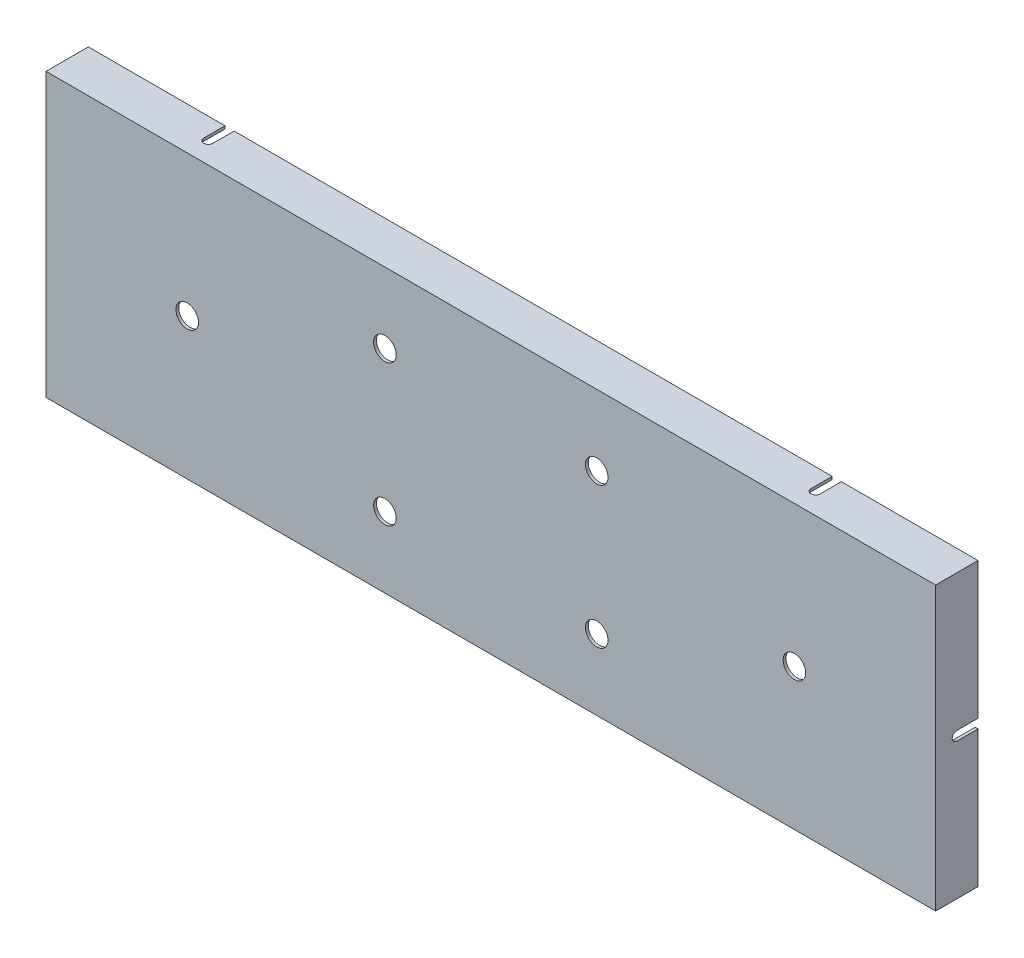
ISO-10303-21;
HEADER;
FILE_DESCRIPTION(('STEP AP214'),'2;1');
FILE_NAME('part.step','',(''),(''),'','','');
FILE_SCHEMA(('AUTOMOTIVE_DESIGN { 1 0 10303 214 1 1 1 1 }'));
ENDSEC;
DATA;
#1=APPLICATION_CONTEXT('core data for automotive mechanical design processes');
#2=APPLICATION_PROTOCOL_DEFINITION('international standard','automotive_design',2000,#1);
#3=PRODUCT_CONTEXT('',#1,'mechanical');
#4=PRODUCT('Part','Part','',(#3));
#5=PRODUCT_RELATED_PRODUCT_CATEGORY('part','',(#4));
#6=PRODUCT_DEFINITION_FORMATION('','',#4);
#7=PRODUCT_DEFINITION_CONTEXT('part definition',#1,'design');
#8=PRODUCT_DEFINITION('design','',#6,#7);
#9=PRODUCT_DEFINITION_SHAPE('','',#8);
#10=(LENGTH_UNIT() NAMED_UNIT(*) SI_UNIT(.MILLI.,.METRE.));
#11=(NAMED_UNIT(*) PLANE_ANGLE_UNIT() SI_UNIT($,.RADIAN.));
#12=(NAMED_UNIT(*) SI_UNIT($,.STERADIAN.) SOLID_ANGLE_UNIT());
#13=UNCERTAINTY_MEASURE_WITH_UNIT(LENGTH_MEASURE(1.E-05),#10,'distance_accuracy_value','');
#14=(GEOMETRIC_REPRESENTATION_CONTEXT(3) GLOBAL_UNCERTAINTY_ASSIGNED_CONTEXT((#13)) GLOBAL_UNIT_ASSIGNED_CONTEXT((#10,
#11,#12)) REPRESENTATION_CONTEXT('',''));
#15=CARTESIAN_POINT('',(0.,0.,0.));
#16=DIRECTION('',(0.,0.,1.));
#17=DIRECTION('',(1.,0.,0.));
#18=AXIS2_PLACEMENT_3D('',#15,#16,#17);
#19=CARTESIAN_POINT('',(0.,-200.,0.));
#20=DIRECTION('',(0.,0.,1.));
#21=DIRECTION('',(1.,0.,0.));
#22=AXIS2_PLACEMENT_3D('',#19,#20,#21);
#23=PLANE('',#22);
#24=DIRECTION('',(0.,1.,0.));
#25=VECTOR('',#24,1.);
#26=CARTESIAN_POINT('',(630.,0.,0.));
#27=LINE('',#26,#25);
#28=CARTESIAN_POINT('',(630.,-96.7499999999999,0.));
#29=VERTEX_POINT('',#28);
#30=CARTESIAN_POINT('',(630.,0.,0.));
#31=VERTEX_POINT('',#30);
#32=EDGE_CURVE('E267',#29,#31,#27,.T.);
#33=ORIENTED_EDGE('',*,*,#32,.F.);
#34=DIRECTION('',(-1.,0.,0.));
#35=VECTOR('',#34,1.);
#36=CARTESIAN_POINT('',(630.,-96.7499999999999,0.));
#37=LINE('',#36,#35);
#38=CARTESIAN_POINT('',(628.,-96.7499999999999,0.));
#39=VERTEX_POINT('',#38);
#40=EDGE_CURVE('E512',#29,#39,#37,.T.);
#41=ORIENTED_EDGE('',*,*,#40,.T.);
#42=DIRECTION('',(0.,1.,0.));
#43=VECTOR('',#42,1.);
#44=CARTESIAN_POINT('',(628.,0.,0.));
#45=LINE('',#44,#43);
#46=CARTESIAN_POINT('',(628.,-2.,0.));
#47=VERTEX_POINT('',#46);
#48=EDGE_CURVE('E323',#39,#47,#45,.T.);
#49=ORIENTED_EDGE('',*,*,#48,.T.);
#50=DIRECTION('',(-1.,0.,0.));
#51=VECTOR('',#50,1.);
#52=CARTESIAN_POINT('',(0.,-2.,0.));
#53=LINE('',#52,#51);
#54=CARTESIAN_POINT('',(533.25,-2.,0.));
#55=VERTEX_POINT('',#54);
#56=EDGE_CURVE('E337',#47,#55,#53,.T.);
#57=ORIENTED_EDGE('',*,*,#56,.T.);
#58=DIRECTION('',(0.,1.,0.));
#59=VECTOR('',#58,1.);
#60=CARTESIAN_POINT('',(533.25,-200.,0.));
#61=LINE('',#60,#59);
#62=CARTESIAN_POINT('',(533.25,0.,0.));
#63=VERTEX_POINT('',#62);
#64=EDGE_CURVE('E487',#55,#63,#61,.T.);
#65=ORIENTED_EDGE('',*,*,#64,.T.);
#66=DIRECTION('',(-1.,0.,0.));
#67=VECTOR('',#66,1.);
#68=CARTESIAN_POINT('',(0.,0.,0.));
#69=LINE('',#68,#67);
#70=EDGE_CURVE('E271',#31,#63,#69,.T.);
#71=ORIENTED_EDGE('',*,*,#70,.F.);
#72=EDGE_LOOP('',(#33,#41,#49,#57,#65,#71));
#73=FACE_BOUND('',#72,.T.);
#74=ADVANCED_FACE('F34',(#73),#23,.F.);
#75=DIRECTION('',(0.,-1.,0.));
#76=VECTOR('',#75,1.);
#77=CARTESIAN_POINT('',(2.,0.,0.));
#78=LINE('',#77,#76);
#79=CARTESIAN_POINT('',(2.,-2.,0.));
#80=VERTEX_POINT('',#79);
#81=CARTESIAN_POINT('',(2.,-96.75,0.));
#82=VERTEX_POINT('',#81);
#83=EDGE_CURVE('E383',#80,#82,#78,.T.);
#84=ORIENTED_EDGE('',*,*,#83,.T.);
#85=CARTESIAN_POINT('',(0.,-96.75,0.));
#86=VERTEX_POINT('',#85);
#87=EDGE_CURVE('E317',#82,#86,#37,.T.);
#88=ORIENTED_EDGE('',*,*,#87,.T.);
#89=DIRECTION('',(0.,-1.,0.));
#90=VECTOR('',#89,1.);
#91=CARTESIAN_POINT('',(0.,0.,0.));
#92=LINE('',#91,#90);
#93=CARTESIAN_POINT('',(0.,0.,0.));
#94=VERTEX_POINT('',#93);
#95=EDGE_CURVE('E346',#94,#86,#92,.T.);
#96=ORIENTED_EDGE('',*,*,#95,.F.);
#97=CARTESIAN_POINT('',(96.75,0.,0.));
#98=VERTEX_POINT('',#97);
#99=EDGE_CURVE('E266',#98,#94,#69,.T.);
#100=ORIENTED_EDGE('',*,*,#99,.F.);
#101=DIRECTION('',(0.,1.,0.));
#102=VECTOR('',#101,1.);
#103=CARTESIAN_POINT('',(96.75,-200.,0.));
#104=LINE('',#103,#102);
#105=CARTESIAN_POINT('',(96.75,-2.,0.));
#106=VERTEX_POINT('',#105);
#107=EDGE_CURVE('E440',#106,#98,#104,.T.);
#108=ORIENTED_EDGE('',*,*,#107,.F.);
#109=EDGE_CURVE('E331',#106,#80,#53,.T.);
#110=ORIENTED_EDGE('',*,*,#109,.T.);
#111=EDGE_LOOP('',(#84,#88,#96,#100,#108,#110));
#112=FACE_BOUND('',#111,.T.);
#113=ADVANCED_FACE('F566',(#112),#23,.F.);
#114=CARTESIAN_POINT('',(628.,-198.,0.));
#115=VERTEX_POINT('',#114);
#116=CARTESIAN_POINT('',(628.,-103.25,0.));
#117=VERTEX_POINT('',#116);
#118=EDGE_CURVE('E258',#115,#117,#45,.T.);
#119=ORIENTED_EDGE('',*,*,#118,.T.);
#120=DIRECTION('',(-1.,0.,0.));
#121=VECTOR('',#120,1.);
#122=CARTESIAN_POINT('',(630.,-103.25,0.));
#123=LINE('',#122,#121);
#124=CARTESIAN_POINT('',(630.,-103.25,0.));
#125=VERTEX_POINT('',#124);
#126=EDGE_CURVE('E57',#125,#117,#123,.T.);
#127=ORIENTED_EDGE('',*,*,#126,.F.);
#128=CARTESIAN_POINT('',(630.,-200.,0.));
#129=VERTEX_POINT('',#128);
#130=EDGE_CURVE('E256',#129,#125,#27,.T.);
#131=ORIENTED_EDGE('',*,*,#130,.F.);
#132=DIRECTION('',(1.,0.,0.));
#133=VECTOR('',#132,1.);
#134=CARTESIAN_POINT('',(0.,-200.,0.));
#135=LINE('',#134,#133);
#136=CARTESIAN_POINT('',(533.25,-200.,0.));
#137=VERTEX_POINT('',#136);
#138=EDGE_CURVE('E348',#137,#129,#135,.T.);
#139=ORIENTED_EDGE('',*,*,#138,.F.);
#140=CARTESIAN_POINT('',(533.25,-198.,0.));
#141=VERTEX_POINT('',#140);
#142=EDGE_CURVE('E475',#137,#141,#61,.T.);
#143=ORIENTED_EDGE('',*,*,#142,.T.);
#144=DIRECTION('',(1.,0.,0.));
#145=VECTOR('',#144,1.);
#146=CARTESIAN_POINT('',(0.,-198.,0.));
#147=LINE('',#146,#145);
#148=EDGE_CURVE('E335',#141,#115,#147,.T.);
#149=ORIENTED_EDGE('',*,*,#148,.T.);
#150=EDGE_LOOP('',(#119,#127,#131,#139,#143,#149));
#151=FACE_BOUND('',#150,.T.);
#152=ADVANCED_FACE('F254',(#151),#23,.F.);
#153=CARTESIAN_POINT('',(526.75,0.,0.));
#154=VERTEX_POINT('',#153);
#155=CARTESIAN_POINT('',(103.25,0.,0.));
#156=VERTEX_POINT('',#155);
#157=EDGE_CURVE('E269',#154,#156,#69,.T.);
#158=ORIENTED_EDGE('',*,*,#157,.F.);
#159=DIRECTION('',(0.,1.,0.));
#160=VECTOR('',#159,1.);
#161=CARTESIAN_POINT('',(526.75,-200.,0.));
#162=LINE('',#161,#160);
#163=CARTESIAN_POINT('',(526.75,-2.,0.));
#164=VERTEX_POINT('',#163);
#165=EDGE_CURVE('E479',#164,#154,#162,.T.);
#166=ORIENTED_EDGE('',*,*,#165,.F.);
#167=CARTESIAN_POINT('',(103.25,-2.,0.));
#168=VERTEX_POINT('',#167);
#169=EDGE_CURVE('E646',#164,#168,#53,.T.);
#170=ORIENTED_EDGE('',*,*,#169,.T.);
#171=DIRECTION('',(0.,1.,0.));
#172=VECTOR('',#171,1.);
#173=CARTESIAN_POINT('',(103.25,-200.,0.));
#174=LINE('',#173,#172);
#175=EDGE_CURVE('E448',#168,#156,#174,.T.);
#176=ORIENTED_EDGE('',*,*,#175,.T.);
#177=EDGE_LOOP('',(#158,#166,#170,#176));
#178=FACE_BOUND('',#177,.T.);
#179=ADVANCED_FACE('F618',(#178),#23,.F.);
#180=CARTESIAN_POINT('',(103.25,-198.,0.));
#181=VERTEX_POINT('',#180);
#182=CARTESIAN_POINT('',(526.75,-198.,0.));
#183=VERTEX_POINT('',#182);
#184=EDGE_CURVE('E333',#181,#183,#147,.T.);
#185=ORIENTED_EDGE('',*,*,#184,.T.);
#186=CARTESIAN_POINT('',(526.75,-200.,0.));
#187=VERTEX_POINT('',#186);
#188=EDGE_CURVE('E476',#187,#183,#162,.T.);
#189=ORIENTED_EDGE('',*,*,#188,.F.);
#190=CARTESIAN_POINT('',(103.25,-200.,0.));
#191=VERTEX_POINT('',#190);
#192=EDGE_CURVE('E353',#191,#187,#135,.T.);
#193=ORIENTED_EDGE('',*,*,#192,.F.);
#194=EDGE_CURVE('E436',#191,#181,#174,.T.);
#195=ORIENTED_EDGE('',*,*,#194,.T.);
#196=EDGE_LOOP('',(#185,#189,#193,#195));
#197=FACE_BOUND('',#196,.T.);
#198=ADVANCED_FACE('F579',(#197),#23,.F.);
#199=CARTESIAN_POINT('',(0.,0.,30.));
#200=DIRECTION('',(1.,0.,0.));
#201=DIRECTION('',(0.,1.,0.));
#202=AXIS2_PLACEMENT_3D('',#199,#200,#201);
#203=PLANE('',#202);
#204=ORIENTED_EDGE('',*,*,#95,.T.);
#205=DIRECTION('',(0.,0.,-1.));
#206=VECTOR('',#205,1.);
#207=CARTESIAN_POINT('',(0.,-96.75,0.));
#208=LINE('',#207,#206);
#209=CARTESIAN_POINT('',(0.,-96.75,15.));
#210=VERTEX_POINT('',#209);
#211=EDGE_CURVE('E249',#210,#86,#208,.T.);
#212=ORIENTED_EDGE('',*,*,#211,.F.);
#213=CARTESIAN_POINT('',(0.,-100.,15.));
#214=DIRECTION('',(-1.,0.,0.));
#215=DIRECTION('',(0.,-1.,0.));
#216=AXIS2_PLACEMENT_3D('',#213,#214,#215);
#217=CIRCLE('',#216,3.25);
#218=CARTESIAN_POINT('',(0.,-103.25,15.));
#219=VERTEX_POINT('',#218);
#220=EDGE_CURVE('E517',#219,#210,#217,.T.);
#221=ORIENTED_EDGE('',*,*,#220,.F.);
#222=DIRECTION('',(0.,0.,1.));
#223=VECTOR('',#222,1.);
#224=CARTESIAN_POINT('',(0.,-103.25,0.));
#225=LINE('',#224,#223);
#226=CARTESIAN_POINT('',(0.,-103.25,0.));
#227=VERTEX_POINT('',#226);
#228=EDGE_CURVE('E520',#227,#219,#225,.T.);
#229=ORIENTED_EDGE('',*,*,#228,.F.);
#230=CARTESIAN_POINT('',(0.,-200.,0.));
#231=VERTEX_POINT('',#230);
#232=EDGE_CURVE('E349',#227,#231,#92,.T.);
#233=ORIENTED_EDGE('',*,*,#232,.T.);
#234=DIRECTION('',(0.,0.,-1.));
#235=VECTOR('',#234,1.);
#236=CARTESIAN_POINT('',(0.,-200.,30.));
#237=LINE('',#236,#235);
#238=CARTESIAN_POINT('',(0.,-200.,30.));
#239=VERTEX_POINT('',#238);
#240=EDGE_CURVE('E286',#239,#231,#237,.T.);
#241=ORIENTED_EDGE('',*,*,#240,.F.);
#242=DIRECTION('',(0.,-1.,0.));
#243=VECTOR('',#242,1.);
#244=CARTESIAN_POINT('',(0.,0.,30.));
#245=LINE('',#244,#243);
#246=CARTESIAN_POINT('',(0.,0.,30.));
#247=VERTEX_POINT('',#246);
#248=EDGE_CURVE('E277',#247,#239,#245,.T.);
#249=ORIENTED_EDGE('',*,*,#248,.F.);
#250=DIRECTION('',(0.,0.,-1.));
#251=VECTOR('',#250,1.);
#252=CARTESIAN_POINT('',(0.,0.,30.));
#253=LINE('',#252,#251);
#254=EDGE_CURVE('E278',#247,#94,#253,.T.);
#255=ORIENTED_EDGE('',*,*,#254,.T.);
#256=EDGE_LOOP('',(#204,#212,#221,#229,#233,#241,#249,#255));
#257=FACE_BOUND('',#256,.T.);
#258=ADVANCED_FACE('F36',(#257),#203,.F.);
#259=CARTESIAN_POINT('',(0.,-200.,30.));
#260=DIRECTION('',(0.,1.,0.));
#261=DIRECTION('',(0.,0.,1.));
#262=AXIS2_PLACEMENT_3D('',#259,#260,#261);
#263=PLANE('',#262);
#264=CARTESIAN_POINT('',(530.,-200.,15.));
#265=DIRECTION('',(0.,1.,0.));
#266=DIRECTION('',(0.,0.,1.));
#267=AXIS2_PLACEMENT_3D('',#264,#265,#266);
#268=CIRCLE('',#267,3.25000000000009);
#269=CARTESIAN_POINT('',(526.75,-200.,15.));
#270=VERTEX_POINT('',#269);
#271=CARTESIAN_POINT('',(533.25,-200.,15.));
#272=VERTEX_POINT('',#271);
#273=EDGE_CURVE('E503',#270,#272,#268,.T.);
#274=ORIENTED_EDGE('',*,*,#273,.T.);
#275=DIRECTION('',(0.,0.,-1.));
#276=VECTOR('',#275,1.);
#277=CARTESIAN_POINT('',(533.25,-200.,0.));
#278=LINE('',#277,#276);
#279=EDGE_CURVE('E500',#272,#137,#278,.T.);
#280=ORIENTED_EDGE('',*,*,#279,.T.);
#281=ORIENTED_EDGE('',*,*,#138,.T.);
#282=DIRECTION('',(0.,0.,-1.));
#283=VECTOR('',#282,1.);
#284=CARTESIAN_POINT('',(630.,-200.,30.));
#285=LINE('',#284,#283);
#286=CARTESIAN_POINT('',(630.,-200.,30.));
#287=VERTEX_POINT('',#286);
#288=EDGE_CURVE('E265',#287,#129,#285,.T.);
#289=ORIENTED_EDGE('',*,*,#288,.F.);
#290=DIRECTION('',(1.,0.,0.));
#291=VECTOR('',#290,1.);
#292=CARTESIAN_POINT('',(0.,-200.,30.));
#293=LINE('',#292,#291);
#294=EDGE_CURVE('E342',#239,#287,#293,.T.);
#295=ORIENTED_EDGE('',*,*,#294,.F.);
#296=ORIENTED_EDGE('',*,*,#240,.T.);
#297=CARTESIAN_POINT('',(96.75,-200.,0.));
#298=VERTEX_POINT('',#297);
#299=EDGE_CURVE('E272',#231,#298,#135,.T.);
#300=ORIENTED_EDGE('',*,*,#299,.T.);
#301=DIRECTION('',(0.,0.,1.));
#302=VECTOR('',#301,1.);
#303=CARTESIAN_POINT('',(96.75,-200.,0.));
#304=LINE('',#303,#302);
#305=CARTESIAN_POINT('',(96.75,-200.,15.));
#306=VERTEX_POINT('',#305);
#307=EDGE_CURVE('E454',#298,#306,#304,.T.);
#308=ORIENTED_EDGE('',*,*,#307,.T.);
#309=CARTESIAN_POINT('',(100.,-200.,15.));
#310=DIRECTION('',(0.,1.,0.));
#311=DIRECTION('',(0.,0.,1.));
#312=AXIS2_PLACEMENT_3D('',#309,#310,#311);
#313=CIRCLE('',#312,3.24999999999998);
#314=CARTESIAN_POINT('',(103.25,-200.,15.));
#315=VERTEX_POINT('',#314);
#316=EDGE_CURVE('E465',#306,#315,#313,.T.);
#317=ORIENTED_EDGE('',*,*,#316,.T.);
#318=DIRECTION('',(0.,0.,-1.));
#319=VECTOR('',#318,1.);
#320=CARTESIAN_POINT('',(103.25,-200.,0.));
#321=LINE('',#320,#319);
#322=EDGE_CURVE('E462',#315,#191,#321,.T.);
#323=ORIENTED_EDGE('',*,*,#322,.T.);
#324=ORIENTED_EDGE('',*,*,#192,.T.);
#325=DIRECTION('',(0.,0.,1.));
#326=VECTOR('',#325,1.);
#327=CARTESIAN_POINT('',(526.75,-200.,0.));
#328=LINE('',#327,#326);
#329=EDGE_CURVE('E492',#187,#270,#328,.T.);
#330=ORIENTED_EDGE('',*,*,#329,.T.);
#331=EDGE_LOOP('',(#274,#280,#281,#289,#295,#296,#300,#308,#317,#323,#324,#330));
#332=FACE_BOUND('',#331,.T.);
#333=ADVANCED_FACE('F537',(#332),#263,.F.);
#334=CARTESIAN_POINT('',(630.,0.,30.));
#335=DIRECTION('',(-1.,0.,0.));
#336=DIRECTION('',(0.,0.,1.));
#337=AXIS2_PLACEMENT_3D('',#334,#335,#336);
#338=PLANE('',#337);
#339=CARTESIAN_POINT('',(630.,-99.9999999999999,15.));
#340=DIRECTION('',(-1.,0.,0.));
#341=DIRECTION('',(0.,-1.,0.));
#342=AXIS2_PLACEMENT_3D('',#339,#340,#341);
#343=CIRCLE('',#342,3.25);
#344=CARTESIAN_POINT('',(630.,-103.25,15.));
#345=VERTEX_POINT('',#344);
#346=CARTESIAN_POINT('',(630.,-96.7499999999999,15.));
#347=VERTEX_POINT('',#346);
#348=EDGE_CURVE('E248',#345,#347,#343,.T.);
#349=ORIENTED_EDGE('',*,*,#348,.T.);
#350=DIRECTION('',(0.,0.,-1.));
#351=VECTOR('',#350,1.);
#352=CARTESIAN_POINT('',(630.,-96.7499999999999,0.));
#353=LINE('',#352,#351);
#354=EDGE_CURVE('E316',#347,#29,#353,.T.);
#355=ORIENTED_EDGE('',*,*,#354,.T.);
#356=ORIENTED_EDGE('',*,*,#32,.T.);
#357=DIRECTION('',(0.,0.,-1.));
#358=VECTOR('',#357,1.);
#359=CARTESIAN_POINT('',(630.,0.,30.));
#360=LINE('',#359,#358);
#361=CARTESIAN_POINT('',(630.,0.,30.));
#362=VERTEX_POINT('',#361);
#363=EDGE_CURVE('E281',#362,#31,#360,.T.);
#364=ORIENTED_EDGE('',*,*,#363,.F.);
#365=DIRECTION('',(0.,1.,0.));
#366=VECTOR('',#365,1.);
#367=CARTESIAN_POINT('',(630.,0.,30.));
#368=LINE('',#367,#366);
#369=EDGE_CURVE('E344',#287,#362,#368,.T.);
#370=ORIENTED_EDGE('',*,*,#369,.F.);
#371=ORIENTED_EDGE('',*,*,#288,.T.);
#372=ORIENTED_EDGE('',*,*,#130,.T.);
#373=DIRECTION('',(0.,0.,1.));
#374=VECTOR('',#373,1.);
#375=CARTESIAN_POINT('',(630.,-103.25,0.));
#376=LINE('',#375,#374);
#377=EDGE_CURVE('E240',#125,#345,#376,.T.);
#378=ORIENTED_EDGE('',*,*,#377,.T.);
#379=EDGE_LOOP('',(#349,#355,#356,#364,#370,#371,#372,#378));
#380=FACE_BOUND('',#379,.T.);
#381=ADVANCED_FACE('F262',(#380),#338,.F.);
#382=CARTESIAN_POINT('',(0.,0.,30.));
#383=DIRECTION('',(0.,-1.,0.));
#384=DIRECTION('',(0.,0.,-1.));
#385=AXIS2_PLACEMENT_3D('',#382,#383,#384);
#386=PLANE('',#385);
#387=ORIENTED_EDGE('',*,*,#70,.T.);
#388=DIRECTION('',(0.,0.,-1.));
#389=VECTOR('',#388,1.);
#390=CARTESIAN_POINT('',(533.25,0.,0.));
#391=LINE('',#390,#389);
#392=CARTESIAN_POINT('',(533.25,0.,15.));
#393=VERTEX_POINT('',#392);
#394=EDGE_CURVE('E490',#393,#63,#391,.T.);
#395=ORIENTED_EDGE('',*,*,#394,.F.);
#396=CARTESIAN_POINT('',(530.,0.,15.));
#397=DIRECTION('',(0.,1.,0.));
#398=DIRECTION('',(0.,0.,1.));
#399=AXIS2_PLACEMENT_3D('',#396,#397,#398);
#400=CIRCLE('',#399,3.25000000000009);
#401=CARTESIAN_POINT('',(526.75,0.,15.));
#402=VERTEX_POINT('',#401);
#403=EDGE_CURVE('E493',#402,#393,#400,.T.);
#404=ORIENTED_EDGE('',*,*,#403,.F.);
#405=DIRECTION('',(0.,0.,1.));
#406=VECTOR('',#405,1.);
#407=CARTESIAN_POINT('',(526.75,0.,0.));
#408=LINE('',#407,#406);
#409=EDGE_CURVE('E496',#154,#402,#408,.T.);
#410=ORIENTED_EDGE('',*,*,#409,.F.);
#411=ORIENTED_EDGE('',*,*,#157,.T.);
#412=DIRECTION('',(0.,0.,-1.));
#413=VECTOR('',#412,1.);
#414=CARTESIAN_POINT('',(103.25,0.,0.));
#415=LINE('',#414,#413);
#416=CARTESIAN_POINT('',(103.25,0.,15.));
#417=VERTEX_POINT('',#416);
#418=EDGE_CURVE('E451',#417,#156,#415,.T.);
#419=ORIENTED_EDGE('',*,*,#418,.F.);
#420=CARTESIAN_POINT('',(100.,0.,15.));
#421=DIRECTION('',(0.,1.,0.));
#422=DIRECTION('',(0.,0.,1.));
#423=AXIS2_PLACEMENT_3D('',#420,#421,#422);
#424=CIRCLE('',#423,3.24999999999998);
#425=CARTESIAN_POINT('',(96.75,0.,15.));
#426=VERTEX_POINT('',#425);
#427=EDGE_CURVE('E455',#426,#417,#424,.T.);
#428=ORIENTED_EDGE('',*,*,#427,.F.);
#429=DIRECTION('',(0.,0.,1.));
#430=VECTOR('',#429,1.);
#431=CARTESIAN_POINT('',(96.75,0.,0.));
#432=LINE('',#431,#430);
#433=EDGE_CURVE('E458',#98,#426,#432,.T.);
#434=ORIENTED_EDGE('',*,*,#433,.F.);
#435=ORIENTED_EDGE('',*,*,#99,.T.);
#436=ORIENTED_EDGE('',*,*,#254,.F.);
#437=DIRECTION('',(-1.,0.,0.));
#438=VECTOR('',#437,1.);
#439=CARTESIAN_POINT('',(0.,0.,30.));
#440=LINE('',#439,#438);
#441=EDGE_CURVE('E282',#362,#247,#440,.T.);
#442=ORIENTED_EDGE('',*,*,#441,.F.);
#443=ORIENTED_EDGE('',*,*,#363,.T.);
#444=EDGE_LOOP('',(#387,#395,#404,#410,#411,#419,#428,#434,#435,#436,#442,#443));
#445=FACE_BOUND('',#444,.T.);
#446=ADVANCED_FACE('F529',(#445),#386,.F.);
#447=CARTESIAN_POINT('',(0.,-200.,30.));
#448=DIRECTION('',(0.,0.,1.));
#449=DIRECTION('',(1.,0.,0.));
#450=AXIS2_PLACEMENT_3D('',#447,#448,#449);
#451=PLANE('',#450);
#452=CARTESIAN_POINT('',(390.,-150.,30.));
#453=DIRECTION('',(0.,0.,1.));
#454=DIRECTION('',(1.,0.,0.));
#455=AXIS2_PLACEMENT_3D('',#452,#453,#454);
#456=CIRCLE('',#455,7.99999999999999);
#457=CARTESIAN_POINT('',(398.,-150.,30.));
#458=VERTEX_POINT('',#457);
#459=EDGE_CURVE('E427',#458,#458,#456,.T.);
#460=ORIENTED_EDGE('',*,*,#459,.F.);
#461=EDGE_LOOP('',(#460));
#462=FACE_BOUND('',#461,.T.);
#463=CARTESIAN_POINT('',(240.,-150.,30.));
#464=DIRECTION('',(0.,0.,1.));
#465=DIRECTION('',(1.,0.,0.));
#466=AXIS2_PLACEMENT_3D('',#463,#464,#465);
#467=CIRCLE('',#466,7.99999999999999);
#468=CARTESIAN_POINT('',(248.,-150.,30.));
#469=VERTEX_POINT('',#468);
#470=EDGE_CURVE('E421',#469,#469,#467,.T.);
#471=ORIENTED_EDGE('',*,*,#470,.F.);
#472=EDGE_LOOP('',(#471));
#473=FACE_BOUND('',#472,.T.);
#474=CARTESIAN_POINT('',(240.,-50.0000000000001,30.));
#475=DIRECTION('',(0.,0.,1.));
#476=DIRECTION('',(1.,0.,0.));
#477=AXIS2_PLACEMENT_3D('',#474,#475,#476);
#478=CIRCLE('',#477,7.99999999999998);
#479=CARTESIAN_POINT('',(248.,-50.0000000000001,30.));
#480=VERTEX_POINT('',#479);
#481=EDGE_CURVE('E415',#480,#480,#478,.T.);
#482=ORIENTED_EDGE('',*,*,#481,.F.);
#483=EDGE_LOOP('',(#482));
#484=FACE_BOUND('',#483,.T.);
#485=CARTESIAN_POINT('',(390.,-50.,30.));
#486=DIRECTION('',(0.,0.,1.));
#487=DIRECTION('',(1.,0.,0.));
#488=AXIS2_PLACEMENT_3D('',#485,#486,#487);
#489=CIRCLE('',#488,7.99999999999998);
#490=CARTESIAN_POINT('',(398.,-50.,30.));
#491=VERTEX_POINT('',#490);
#492=EDGE_CURVE('E409',#491,#491,#489,.T.);
#493=ORIENTED_EDGE('',*,*,#492,.F.);
#494=EDGE_LOOP('',(#493));
#495=FACE_BOUND('',#494,.T.);
#496=CARTESIAN_POINT('',(100.,-100.,30.));
#497=DIRECTION('',(0.,0.,1.));
#498=DIRECTION('',(1.,0.,0.));
#499=AXIS2_PLACEMENT_3D('',#496,#497,#498);
#500=CIRCLE('',#499,8.00000000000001);
#501=CARTESIAN_POINT('',(108.,-100.,30.));
#502=VERTEX_POINT('',#501);
#503=EDGE_CURVE('E401',#502,#502,#500,.T.);
#504=ORIENTED_EDGE('',*,*,#503,.F.);
#505=EDGE_LOOP('',(#504));
#506=FACE_BOUND('',#505,.T.);
#507=CARTESIAN_POINT('',(530.,-100.,30.));
#508=DIRECTION('',(0.,0.,1.));
#509=DIRECTION('',(1.,0.,0.));
#510=AXIS2_PLACEMENT_3D('',#507,#508,#509);
#511=CIRCLE('',#510,7.99999999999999);
#512=CARTESIAN_POINT('',(538.,-100.,30.));
#513=VERTEX_POINT('',#512);
#514=EDGE_CURVE('E393',#513,#513,#511,.T.);
#515=ORIENTED_EDGE('',*,*,#514,.F.);
#516=EDGE_LOOP('',(#515));
#517=FACE_BOUND('',#516,.T.);
#518=ORIENTED_EDGE('',*,*,#248,.T.);
#519=ORIENTED_EDGE('',*,*,#294,.T.);
#520=ORIENTED_EDGE('',*,*,#369,.T.);
#521=ORIENTED_EDGE('',*,*,#441,.T.);
#522=EDGE_LOOP('',(#518,#519,#520,#521));
#523=FACE_BOUND('',#522,.T.);
#524=ADVANCED_FACE('F534',(#462,#473,#484,#495,#506,#517,#523),#451,.T.);
#525=ORIENTED_EDGE('',*,*,#232,.F.);
#526=CARTESIAN_POINT('',(2.,-103.25,0.));
#527=VERTEX_POINT('',#526);
#528=EDGE_CURVE('E259',#527,#227,#123,.T.);
#529=ORIENTED_EDGE('',*,*,#528,.F.);
#530=CARTESIAN_POINT('',(2.00000000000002,-198.,0.));
#531=VERTEX_POINT('',#530);
#532=EDGE_CURVE('E385',#527,#531,#78,.T.);
#533=ORIENTED_EDGE('',*,*,#532,.T.);
#534=CARTESIAN_POINT('',(96.75,-198.,0.));
#535=VERTEX_POINT('',#534);
#536=EDGE_CURVE('E329',#531,#535,#147,.T.);
#537=ORIENTED_EDGE('',*,*,#536,.T.);
#538=EDGE_CURVE('E437',#298,#535,#104,.T.);
#539=ORIENTED_EDGE('',*,*,#538,.F.);
#540=ORIENTED_EDGE('',*,*,#299,.F.);
#541=EDGE_LOOP('',(#525,#529,#533,#537,#539,#540));
#542=FACE_BOUND('',#541,.T.);
#543=ADVANCED_FACE('F602',(#542),#23,.F.);
#544=CARTESIAN_POINT('',(2.,0.,30.));
#545=DIRECTION('',(1.,0.,0.));
#546=DIRECTION('',(0.,1.,0.));
#547=AXIS2_PLACEMENT_3D('',#544,#545,#546);
#548=PLANE('',#547);
#549=DIRECTION('',(0.,0.,1.));
#550=VECTOR('',#549,1.);
#551=CARTESIAN_POINT('',(2.00000000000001,-96.75,30.));
#552=LINE('',#551,#550);
#553=CARTESIAN_POINT('',(2.,-96.75,15.));
#554=VERTEX_POINT('',#553);
#555=EDGE_CURVE('E499',#82,#554,#552,.T.);
#556=ORIENTED_EDGE('',*,*,#555,.F.);
#557=ORIENTED_EDGE('',*,*,#83,.F.);
#558=DIRECTION('',(0.,0.,-1.));
#559=VECTOR('',#558,1.);
#560=CARTESIAN_POINT('',(2.,-2.,30.));
#561=LINE('',#560,#559);
#562=CARTESIAN_POINT('',(2.,-2.,28.));
#563=VERTEX_POINT('',#562);
#564=EDGE_CURVE('E375',#563,#80,#561,.T.);
#565=ORIENTED_EDGE('',*,*,#564,.F.);
#566=DIRECTION('',(0.,-1.,0.));
#567=VECTOR('',#566,1.);
#568=CARTESIAN_POINT('',(2.,0.,28.));
#569=LINE('',#568,#567);
#570=CARTESIAN_POINT('',(2.00000000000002,-198.,28.));
#571=VERTEX_POINT('',#570);
#572=EDGE_CURVE('E372',#563,#571,#569,.T.);
#573=ORIENTED_EDGE('',*,*,#572,.T.);
#574=DIRECTION('',(0.,0.,-1.));
#575=VECTOR('',#574,1.);
#576=CARTESIAN_POINT('',(2.00000000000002,-198.,30.));
#577=LINE('',#576,#575);
#578=EDGE_CURVE('E354',#571,#531,#577,.T.);
#579=ORIENTED_EDGE('',*,*,#578,.T.);
#580=ORIENTED_EDGE('',*,*,#532,.F.);
#581=DIRECTION('',(0.,0.,-1.));
#582=VECTOR('',#581,1.);
#583=CARTESIAN_POINT('',(2.00000000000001,-103.25,30.));
#584=LINE('',#583,#582);
#585=CARTESIAN_POINT('',(2.00000000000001,-103.25,15.));
#586=VERTEX_POINT('',#585);
#587=EDGE_CURVE('E511',#586,#527,#584,.T.);
#588=ORIENTED_EDGE('',*,*,#587,.F.);
#589=CARTESIAN_POINT('',(2.,-100.,15.));
#590=DIRECTION('',(1.,0.,0.));
#591=DIRECTION('',(0.,1.,0.));
#592=AXIS2_PLACEMENT_3D('',#589,#590,#591);
#593=CIRCLE('',#592,3.25);
#594=EDGE_CURVE('E509',#554,#586,#593,.T.);
#595=ORIENTED_EDGE('',*,*,#594,.F.);
#596=EDGE_LOOP('',(#556,#557,#565,#573,#579,#580,#588,#595));
#597=FACE_BOUND('',#596,.T.);
#598=ADVANCED_FACE('F557',(#597),#548,.T.);
#599=CARTESIAN_POINT('',(0.,-198.,30.));
#600=DIRECTION('',(0.,1.,0.));
#601=DIRECTION('',(0.,0.,1.));
#602=AXIS2_PLACEMENT_3D('',#599,#600,#601);
#603=PLANE('',#602);
#604=DIRECTION('',(0.,0.,-1.));
#605=VECTOR('',#604,1.);
#606=CARTESIAN_POINT('',(533.25,-198.,30.));
#607=LINE('',#606,#605);
#608=CARTESIAN_POINT('',(533.25,-198.,15.));
#609=VERTEX_POINT('',#608);
#610=EDGE_CURVE('E461',#609,#141,#607,.T.);
#611=ORIENTED_EDGE('',*,*,#610,.F.);
#612=CARTESIAN_POINT('',(530.,-198.,15.));
#613=DIRECTION('',(0.,1.,0.));
#614=DIRECTION('',(0.,0.,1.));
#615=AXIS2_PLACEMENT_3D('',#612,#613,#614);
#616=CIRCLE('',#615,3.25000000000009);
#617=CARTESIAN_POINT('',(526.75,-198.,15.));
#618=VERTEX_POINT('',#617);
#619=EDGE_CURVE('E471',#618,#609,#616,.T.);
#620=ORIENTED_EDGE('',*,*,#619,.F.);
#621=DIRECTION('',(0.,0.,1.));
#622=VECTOR('',#621,1.);
#623=CARTESIAN_POINT('',(526.75,-198.,30.));
#624=LINE('',#623,#622);
#625=EDGE_CURVE('E473',#183,#618,#624,.T.);
#626=ORIENTED_EDGE('',*,*,#625,.F.);
#627=ORIENTED_EDGE('',*,*,#184,.F.);
#628=DIRECTION('',(0.,0.,-1.));
#629=VECTOR('',#628,1.);
#630=CARTESIAN_POINT('',(103.25,-198.,30.));
#631=LINE('',#630,#629);
#632=CARTESIAN_POINT('',(103.25,-198.,15.));
#633=VERTEX_POINT('',#632);
#634=EDGE_CURVE('E430',#633,#181,#631,.T.);
#635=ORIENTED_EDGE('',*,*,#634,.F.);
#636=CARTESIAN_POINT('',(100.,-198.,15.));
#637=DIRECTION('',(0.,1.,0.));
#638=DIRECTION('',(0.,0.,1.));
#639=AXIS2_PLACEMENT_3D('',#636,#637,#638);
#640=CIRCLE('',#639,3.24999999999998);
#641=CARTESIAN_POINT('',(96.75,-198.,15.));
#642=VERTEX_POINT('',#641);
#643=EDGE_CURVE('E432',#642,#633,#640,.T.);
#644=ORIENTED_EDGE('',*,*,#643,.F.);
#645=DIRECTION('',(0.,0.,1.));
#646=VECTOR('',#645,1.);
#647=CARTESIAN_POINT('',(96.75,-198.,30.));
#648=LINE('',#647,#646);
#649=EDGE_CURVE('E434',#535,#642,#648,.T.);
#650=ORIENTED_EDGE('',*,*,#649,.F.);
#651=ORIENTED_EDGE('',*,*,#536,.F.);
#652=ORIENTED_EDGE('',*,*,#578,.F.);
#653=DIRECTION('',(1.,0.,0.));
#654=VECTOR('',#653,1.);
#655=CARTESIAN_POINT('',(0.,-198.,28.));
#656=LINE('',#655,#654);
#657=CARTESIAN_POINT('',(628.,-198.,28.));
#658=VERTEX_POINT('',#657);
#659=EDGE_CURVE('E374',#571,#658,#656,.T.);
#660=ORIENTED_EDGE('',*,*,#659,.T.);
#661=DIRECTION('',(0.,0.,-1.));
#662=VECTOR('',#661,1.);
#663=CARTESIAN_POINT('',(628.,-198.,30.));
#664=LINE('',#663,#662);
#665=EDGE_CURVE('E360',#658,#115,#664,.T.);
#666=ORIENTED_EDGE('',*,*,#665,.T.);
#667=ORIENTED_EDGE('',*,*,#148,.F.);
#668=EDGE_LOOP('',(#611,#620,#626,#627,#635,#644,#650,#651,#652,#660,#666,#667));
#669=FACE_BOUND('',#668,.T.);
#670=ADVANCED_FACE('F543',(#669),#603,.T.);
#671=CARTESIAN_POINT('',(628.,0.,30.));
#672=DIRECTION('',(-1.,0.,0.));
#673=DIRECTION('',(0.,0.,1.));
#674=AXIS2_PLACEMENT_3D('',#671,#672,#673);
#675=PLANE('',#674);
#676=DIRECTION('',(0.,0.,-1.));
#677=VECTOR('',#676,1.);
#678=CARTESIAN_POINT('',(628.,-96.7499999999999,30.));
#679=LINE('',#678,#677);
#680=CARTESIAN_POINT('',(628.,-96.7499999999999,15.));
#681=VERTEX_POINT('',#680);
#682=EDGE_CURVE('E11',#681,#39,#679,.T.);
#683=ORIENTED_EDGE('',*,*,#682,.F.);
#684=CARTESIAN_POINT('',(628.,-99.9999999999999,15.));
#685=DIRECTION('',(-1.,0.,0.));
#686=DIRECTION('',(0.,0.,1.));
#687=AXIS2_PLACEMENT_3D('',#684,#685,#686);
#688=CIRCLE('',#687,3.25);
#689=CARTESIAN_POINT('',(628.,-103.25,15.));
#690=VERTEX_POINT('',#689);
#691=EDGE_CURVE('E42',#690,#681,#688,.T.);
#692=ORIENTED_EDGE('',*,*,#691,.F.);
#693=DIRECTION('',(0.,0.,1.));
#694=VECTOR('',#693,1.);
#695=CARTESIAN_POINT('',(628.,-103.25,30.));
#696=LINE('',#695,#694);
#697=EDGE_CURVE('E303',#117,#690,#696,.T.);
#698=ORIENTED_EDGE('',*,*,#697,.F.);
#699=ORIENTED_EDGE('',*,*,#118,.F.);
#700=ORIENTED_EDGE('',*,*,#665,.F.);
#701=DIRECTION('',(0.,1.,0.));
#702=VECTOR('',#701,1.);
#703=CARTESIAN_POINT('',(628.,0.,28.));
#704=LINE('',#703,#702);
#705=CARTESIAN_POINT('',(628.,-2.,28.));
#706=VERTEX_POINT('',#705);
#707=EDGE_CURVE('E380',#658,#706,#704,.T.);
#708=ORIENTED_EDGE('',*,*,#707,.T.);
#709=DIRECTION('',(0.,0.,-1.));
#710=VECTOR('',#709,1.);
#711=CARTESIAN_POINT('',(628.,-2.,30.));
#712=LINE('',#711,#710);
#713=EDGE_CURVE('E325',#706,#47,#712,.T.);
#714=ORIENTED_EDGE('',*,*,#713,.T.);
#715=ORIENTED_EDGE('',*,*,#48,.F.);
#716=EDGE_LOOP('',(#683,#692,#698,#699,#700,#708,#714,#715));
#717=FACE_BOUND('',#716,.T.);
#718=ADVANCED_FACE('F321',(#717),#675,.T.);
#719=CARTESIAN_POINT('',(0.,-2.,30.));
#720=DIRECTION('',(0.,-1.,0.));
#721=DIRECTION('',(0.,0.,-1.));
#722=AXIS2_PLACEMENT_3D('',#719,#720,#721);
#723=PLANE('',#722);
#724=DIRECTION('',(0.,0.,1.));
#725=VECTOR('',#724,1.);
#726=CARTESIAN_POINT('',(533.25,-2.,30.));
#727=LINE('',#726,#725);
#728=CARTESIAN_POINT('',(533.25,-2.,15.));
#729=VERTEX_POINT('',#728);
#730=EDGE_CURVE('E301',#55,#729,#727,.T.);
#731=ORIENTED_EDGE('',*,*,#730,.F.);
#732=ORIENTED_EDGE('',*,*,#56,.F.);
#733=ORIENTED_EDGE('',*,*,#713,.F.);
#734=DIRECTION('',(-1.,0.,0.));
#735=VECTOR('',#734,1.);
#736=CARTESIAN_POINT('',(0.,-2.,28.));
#737=LINE('',#736,#735);
#738=EDGE_CURVE('E377',#706,#563,#737,.T.);
#739=ORIENTED_EDGE('',*,*,#738,.T.);
#740=ORIENTED_EDGE('',*,*,#564,.T.);
#741=ORIENTED_EDGE('',*,*,#109,.F.);
#742=DIRECTION('',(0.,0.,-1.));
#743=VECTOR('',#742,1.);
#744=CARTESIAN_POINT('',(96.75,-2.,30.));
#745=LINE('',#744,#743);
#746=CARTESIAN_POINT('',(96.75,-2.,15.));
#747=VERTEX_POINT('',#746);
#748=EDGE_CURVE('E289',#747,#106,#745,.T.);
#749=ORIENTED_EDGE('',*,*,#748,.F.);
#750=CARTESIAN_POINT('',(100.,-2.,15.));
#751=DIRECTION('',(0.,-1.,0.));
#752=DIRECTION('',(0.,0.,-1.));
#753=AXIS2_PLACEMENT_3D('',#750,#751,#752);
#754=CIRCLE('',#753,3.24999999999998);
#755=CARTESIAN_POINT('',(103.25,-2.,15.));
#756=VERTEX_POINT('',#755);
#757=EDGE_CURVE('E291',#756,#747,#754,.T.);
#758=ORIENTED_EDGE('',*,*,#757,.F.);
#759=DIRECTION('',(0.,0.,1.));
#760=VECTOR('',#759,1.);
#761=CARTESIAN_POINT('',(103.25,-2.,30.));
#762=LINE('',#761,#760);
#763=EDGE_CURVE('E294',#168,#756,#762,.T.);
#764=ORIENTED_EDGE('',*,*,#763,.F.);
#765=ORIENTED_EDGE('',*,*,#169,.F.);
#766=DIRECTION('',(0.,0.,-1.));
#767=VECTOR('',#766,1.);
#768=CARTESIAN_POINT('',(526.75,-2.,30.));
#769=LINE('',#768,#767);
#770=CARTESIAN_POINT('',(526.75,-2.,15.));
#771=VERTEX_POINT('',#770);
#772=EDGE_CURVE('E296',#771,#164,#769,.T.);
#773=ORIENTED_EDGE('',*,*,#772,.F.);
#774=CARTESIAN_POINT('',(530.,-2.,15.));
#775=DIRECTION('',(0.,-1.,0.));
#776=DIRECTION('',(0.,0.,-1.));
#777=AXIS2_PLACEMENT_3D('',#774,#775,#776);
#778=CIRCLE('',#777,3.25000000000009);
#779=EDGE_CURVE('E298',#729,#771,#778,.T.);
#780=ORIENTED_EDGE('',*,*,#779,.F.);
#781=EDGE_LOOP('',(#731,#732,#733,#739,#740,#741,#749,#758,#764,#765,#773,#780));
#782=FACE_BOUND('',#781,.T.);
#783=ADVANCED_FACE('F554',(#782),#723,.T.);
#784=CARTESIAN_POINT('',(0.,-200.,28.));
#785=DIRECTION('',(0.,0.,1.));
#786=DIRECTION('',(1.,0.,0.));
#787=AXIS2_PLACEMENT_3D('',#784,#785,#786);
#788=PLANE('',#787);
#789=CARTESIAN_POINT('',(390.,-150.,28.));
#790=DIRECTION('',(0.,0.,1.));
#791=DIRECTION('',(1.,0.,0.));
#792=AXIS2_PLACEMENT_3D('',#789,#790,#791);
#793=CIRCLE('',#792,7.99999999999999);
#794=CARTESIAN_POINT('',(398.,-150.,28.));
#795=VERTEX_POINT('',#794);
#796=EDGE_CURVE('E424',#795,#795,#793,.F.);
#797=ORIENTED_EDGE('',*,*,#796,.F.);
#798=EDGE_LOOP('',(#797));
#799=FACE_BOUND('',#798,.T.);
#800=CARTESIAN_POINT('',(240.,-150.,28.));
#801=DIRECTION('',(0.,0.,1.));
#802=DIRECTION('',(1.,0.,0.));
#803=AXIS2_PLACEMENT_3D('',#800,#801,#802);
#804=CIRCLE('',#803,7.99999999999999);
#805=CARTESIAN_POINT('',(248.,-150.,28.));
#806=VERTEX_POINT('',#805);
#807=EDGE_CURVE('E418',#806,#806,#804,.F.);
#808=ORIENTED_EDGE('',*,*,#807,.F.);
#809=EDGE_LOOP('',(#808));
#810=FACE_BOUND('',#809,.T.);
#811=CARTESIAN_POINT('',(240.,-50.0000000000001,28.));
#812=DIRECTION('',(0.,0.,1.));
#813=DIRECTION('',(1.,0.,0.));
#814=AXIS2_PLACEMENT_3D('',#811,#812,#813);
#815=CIRCLE('',#814,7.99999999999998);
#816=CARTESIAN_POINT('',(248.,-50.0000000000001,28.));
#817=VERTEX_POINT('',#816);
#818=EDGE_CURVE('E412',#817,#817,#815,.F.);
#819=ORIENTED_EDGE('',*,*,#818,.F.);
#820=EDGE_LOOP('',(#819));
#821=FACE_BOUND('',#820,.T.);
#822=CARTESIAN_POINT('',(390.,-50.,28.));
#823=DIRECTION('',(0.,0.,1.));
#824=DIRECTION('',(1.,0.,0.));
#825=AXIS2_PLACEMENT_3D('',#822,#823,#824);
#826=CIRCLE('',#825,7.99999999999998);
#827=CARTESIAN_POINT('',(398.,-50.,28.));
#828=VERTEX_POINT('',#827);
#829=EDGE_CURVE('E406',#828,#828,#826,.F.);
#830=ORIENTED_EDGE('',*,*,#829,.F.);
#831=EDGE_LOOP('',(#830));
#832=FACE_BOUND('',#831,.T.);
#833=CARTESIAN_POINT('',(100.,-100.,28.));
#834=DIRECTION('',(0.,0.,1.));
#835=DIRECTION('',(1.,0.,0.));
#836=AXIS2_PLACEMENT_3D('',#833,#834,#835);
#837=CIRCLE('',#836,8.00000000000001);
#838=CARTESIAN_POINT('',(108.,-100.,28.));
#839=VERTEX_POINT('',#838);
#840=EDGE_CURVE('E397',#839,#839,#837,.F.);
#841=ORIENTED_EDGE('',*,*,#840,.F.);
#842=EDGE_LOOP('',(#841));
#843=FACE_BOUND('',#842,.T.);
#844=CARTESIAN_POINT('',(530.,-100.,28.));
#845=DIRECTION('',(0.,0.,1.));
#846=DIRECTION('',(1.,0.,0.));
#847=AXIS2_PLACEMENT_3D('',#844,#845,#846);
#848=CIRCLE('',#847,7.99999999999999);
#849=CARTESIAN_POINT('',(538.,-100.,28.));
#850=VERTEX_POINT('',#849);
#851=EDGE_CURVE('E370',#850,#850,#848,.F.);
#852=ORIENTED_EDGE('',*,*,#851,.F.);
#853=EDGE_LOOP('',(#852));
#854=FACE_BOUND('',#853,.T.);
#855=ORIENTED_EDGE('',*,*,#572,.F.);
#856=ORIENTED_EDGE('',*,*,#738,.F.);
#857=ORIENTED_EDGE('',*,*,#707,.F.);
#858=ORIENTED_EDGE('',*,*,#659,.F.);
#859=EDGE_LOOP('',(#855,#856,#857,#858));
#860=FACE_BOUND('',#859,.T.);
#861=ADVANCED_FACE('F550',(#799,#810,#821,#832,#843,#854,#860),#788,.F.);
#862=CARTESIAN_POINT('',(530.,-100.,-0.001000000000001));
#863=DIRECTION('',(0.,0.,1.));
#864=DIRECTION('',(1.,0.,0.));
#865=AXIS2_PLACEMENT_3D('',#862,#863,#864);
#866=CYLINDRICAL_SURFACE('',#865,7.99999999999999);
#867=ORIENTED_EDGE('',*,*,#514,.T.);
#868=EDGE_LOOP('',(#867));
#869=FACE_BOUND('',#868,.T.);
#870=ORIENTED_EDGE('',*,*,#851,.T.);
#871=EDGE_LOOP('',(#870));
#872=FACE_BOUND('',#871,.T.);
#873=ADVANCED_FACE('F845',(#869,#872),#866,.F.);
#874=CARTESIAN_POINT('',(100.,-100.,-0.001000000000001));
#875=DIRECTION('',(0.,0.,1.));
#876=DIRECTION('',(1.,0.,0.));
#877=AXIS2_PLACEMENT_3D('',#874,#875,#876);
#878=CYLINDRICAL_SURFACE('',#877,8.00000000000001);
#879=ORIENTED_EDGE('',*,*,#503,.T.);
#880=EDGE_LOOP('',(#879));
#881=FACE_BOUND('',#880,.T.);
#882=ORIENTED_EDGE('',*,*,#840,.T.);
#883=EDGE_LOOP('',(#882));
#884=FACE_BOUND('',#883,.T.);
#885=ADVANCED_FACE('F836',(#881,#884),#878,.F.);
#886=CARTESIAN_POINT('',(390.,-50.,-0.001000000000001));
#887=DIRECTION('',(0.,0.,1.));
#888=DIRECTION('',(1.,0.,0.));
#889=AXIS2_PLACEMENT_3D('',#886,#887,#888);
#890=CYLINDRICAL_SURFACE('',#889,7.99999999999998);
#891=ORIENTED_EDGE('',*,*,#492,.T.);
#892=EDGE_LOOP('',(#891));
#893=FACE_BOUND('',#892,.T.);
#894=ORIENTED_EDGE('',*,*,#829,.T.);
#895=EDGE_LOOP('',(#894));
#896=FACE_BOUND('',#895,.T.);
#897=ADVANCED_FACE('F827',(#893,#896),#890,.F.);
#898=CARTESIAN_POINT('',(240.,-50.0000000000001,-0.001000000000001));
#899=DIRECTION('',(0.,0.,1.));
#900=DIRECTION('',(1.,0.,0.));
#901=AXIS2_PLACEMENT_3D('',#898,#899,#900);
#902=CYLINDRICAL_SURFACE('',#901,7.99999999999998);
#903=ORIENTED_EDGE('',*,*,#481,.T.);
#904=EDGE_LOOP('',(#903));
#905=FACE_BOUND('',#904,.T.);
#906=ORIENTED_EDGE('',*,*,#818,.T.);
#907=EDGE_LOOP('',(#906));
#908=FACE_BOUND('',#907,.T.);
#909=ADVANCED_FACE('F818',(#905,#908),#902,.F.);
#910=CARTESIAN_POINT('',(240.,-150.,-0.001000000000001));
#911=DIRECTION('',(0.,0.,1.));
#912=DIRECTION('',(1.,0.,0.));
#913=AXIS2_PLACEMENT_3D('',#910,#911,#912);
#914=CYLINDRICAL_SURFACE('',#913,7.99999999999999);
#915=ORIENTED_EDGE('',*,*,#470,.T.);
#916=EDGE_LOOP('',(#915));
#917=FACE_BOUND('',#916,.T.);
#918=ORIENTED_EDGE('',*,*,#807,.T.);
#919=EDGE_LOOP('',(#918));
#920=FACE_BOUND('',#919,.T.);
#921=ADVANCED_FACE('F809',(#917,#920),#914,.F.);
#922=CARTESIAN_POINT('',(390.,-150.,-0.001000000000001));
#923=DIRECTION('',(0.,0.,1.));
#924=DIRECTION('',(1.,0.,0.));
#925=AXIS2_PLACEMENT_3D('',#922,#923,#924);
#926=CYLINDRICAL_SURFACE('',#925,7.99999999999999);
#927=ORIENTED_EDGE('',*,*,#459,.T.);
#928=EDGE_LOOP('',(#927));
#929=FACE_BOUND('',#928,.T.);
#930=ORIENTED_EDGE('',*,*,#796,.T.);
#931=EDGE_LOOP('',(#930));
#932=FACE_BOUND('',#931,.T.);
#933=ADVANCED_FACE('F789',(#929,#932),#926,.F.);
#934=CARTESIAN_POINT('',(96.75,-200.,0.));
#935=DIRECTION('',(-1.,0.,0.));
#936=DIRECTION('',(0.,0.,1.));
#937=AXIS2_PLACEMENT_3D('',#934,#935,#936);
#938=PLANE('',#937);
#939=ORIENTED_EDGE('',*,*,#748,.T.);
#940=ORIENTED_EDGE('',*,*,#107,.T.);
#941=ORIENTED_EDGE('',*,*,#433,.T.);
#942=DIRECTION('',(0.,1.,0.));
#943=VECTOR('',#942,1.);
#944=CARTESIAN_POINT('',(96.75,-200.,15.));
#945=LINE('',#944,#943);
#946=EDGE_CURVE('E439',#747,#426,#945,.T.);
#947=ORIENTED_EDGE('',*,*,#946,.F.);
#948=EDGE_LOOP('',(#939,#940,#941,#947));
#949=FACE_BOUND('',#948,.T.);
#950=ADVANCED_FACE('F645',(#949),#938,.F.);
#951=CARTESIAN_POINT('',(100.,-200.,15.));
#952=DIRECTION('',(0.,1.,0.));
#953=DIRECTION('',(0.,0.,1.));
#954=AXIS2_PLACEMENT_3D('',#951,#952,#953);
#955=CYLINDRICAL_SURFACE('',#954,3.24999999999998);
#956=ORIENTED_EDGE('',*,*,#757,.T.);
#957=ORIENTED_EDGE('',*,*,#946,.T.);
#958=ORIENTED_EDGE('',*,*,#427,.T.);
#959=DIRECTION('',(0.,1.,0.));
#960=VECTOR('',#959,1.);
#961=CARTESIAN_POINT('',(103.25,-200.,15.));
#962=LINE('',#961,#960);
#963=EDGE_CURVE('E444',#756,#417,#962,.T.);
#964=ORIENTED_EDGE('',*,*,#963,.F.);
#965=EDGE_LOOP('',(#956,#957,#958,#964));
#966=FACE_BOUND('',#965,.T.);
#967=ADVANCED_FACE('F642',(#966),#955,.F.);
#968=CARTESIAN_POINT('',(103.25,-200.,0.));
#969=DIRECTION('',(1.,0.,0.));
#970=DIRECTION('',(0.,0.,-1.));
#971=AXIS2_PLACEMENT_3D('',#968,#969,#970);
#972=PLANE('',#971);
#973=ORIENTED_EDGE('',*,*,#763,.T.);
#974=ORIENTED_EDGE('',*,*,#963,.T.);
#975=ORIENTED_EDGE('',*,*,#418,.T.);
#976=ORIENTED_EDGE('',*,*,#175,.F.);
#977=EDGE_LOOP('',(#973,#974,#975,#976));
#978=FACE_BOUND('',#977,.T.);
#979=ADVANCED_FACE('F637',(#978),#972,.F.);
#980=ORIENTED_EDGE('',*,*,#634,.T.);
#981=ORIENTED_EDGE('',*,*,#194,.F.);
#982=ORIENTED_EDGE('',*,*,#322,.F.);
#983=EDGE_CURVE('E445',#315,#633,#962,.T.);
#984=ORIENTED_EDGE('',*,*,#983,.T.);
#985=EDGE_LOOP('',(#980,#981,#982,#984));
#986=FACE_BOUND('',#985,.T.);
#987=ADVANCED_FACE('F762',(#986),#972,.F.);
#988=ORIENTED_EDGE('',*,*,#643,.T.);
#989=ORIENTED_EDGE('',*,*,#983,.F.);
#990=ORIENTED_EDGE('',*,*,#316,.F.);
#991=EDGE_CURVE('E441',#306,#642,#945,.T.);
#992=ORIENTED_EDGE('',*,*,#991,.T.);
#993=EDGE_LOOP('',(#988,#989,#990,#992));
#994=FACE_BOUND('',#993,.T.);
#995=ADVANCED_FACE('F660',(#994),#955,.F.);
#996=ORIENTED_EDGE('',*,*,#649,.T.);
#997=ORIENTED_EDGE('',*,*,#991,.F.);
#998=ORIENTED_EDGE('',*,*,#307,.F.);
#999=ORIENTED_EDGE('',*,*,#538,.T.);
#1000=EDGE_LOOP('',(#996,#997,#998,#999));
#1001=FACE_BOUND('',#1000,.T.);
#1002=ADVANCED_FACE('F654',(#1001),#938,.F.);
#1003=CARTESIAN_POINT('',(526.75,-200.,0.));
#1004=DIRECTION('',(-1.,0.,0.));
#1005=DIRECTION('',(0.,0.,1.));
#1006=AXIS2_PLACEMENT_3D('',#1003,#1004,#1005);
#1007=PLANE('',#1006);
#1008=ORIENTED_EDGE('',*,*,#772,.T.);
#1009=ORIENTED_EDGE('',*,*,#165,.T.);
#1010=ORIENTED_EDGE('',*,*,#409,.T.);
#1011=DIRECTION('',(0.,1.,0.));
#1012=VECTOR('',#1011,1.);
#1013=CARTESIAN_POINT('',(526.75,-200.,15.));
#1014=LINE('',#1013,#1012);
#1015=EDGE_CURVE('E478',#771,#402,#1014,.T.);
#1016=ORIENTED_EDGE('',*,*,#1015,.F.);
#1017=EDGE_LOOP('',(#1008,#1009,#1010,#1016));
#1018=FACE_BOUND('',#1017,.T.);
#1019=ADVANCED_FACE('F652',(#1018),#1007,.F.);
#1020=CARTESIAN_POINT('',(530.,-200.,15.));
#1021=DIRECTION('',(0.,1.,0.));
#1022=DIRECTION('',(0.,0.,1.));
#1023=AXIS2_PLACEMENT_3D('',#1020,#1021,#1022);
#1024=CYLINDRICAL_SURFACE('',#1023,3.25000000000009);
#1025=ORIENTED_EDGE('',*,*,#779,.T.);
#1026=ORIENTED_EDGE('',*,*,#1015,.T.);
#1027=ORIENTED_EDGE('',*,*,#403,.T.);
#1028=DIRECTION('',(0.,1.,0.));
#1029=VECTOR('',#1028,1.);
#1030=CARTESIAN_POINT('',(533.25,-200.,15.));
#1031=LINE('',#1030,#1029);
#1032=EDGE_CURVE('E483',#729,#393,#1031,.T.);
#1033=ORIENTED_EDGE('',*,*,#1032,.F.);
#1034=EDGE_LOOP('',(#1025,#1026,#1027,#1033));
#1035=FACE_BOUND('',#1034,.T.);
#1036=ADVANCED_FACE('F597',(#1035),#1024,.F.);
#1037=CARTESIAN_POINT('',(533.25,-200.,0.));
#1038=DIRECTION('',(1.,0.,0.));
#1039=DIRECTION('',(0.,0.,-1.));
#1040=AXIS2_PLACEMENT_3D('',#1037,#1038,#1039);
#1041=PLANE('',#1040);
#1042=ORIENTED_EDGE('',*,*,#730,.T.);
#1043=ORIENTED_EDGE('',*,*,#1032,.T.);
#1044=ORIENTED_EDGE('',*,*,#394,.T.);
#1045=ORIENTED_EDGE('',*,*,#64,.F.);
#1046=EDGE_LOOP('',(#1042,#1043,#1044,#1045));
#1047=FACE_BOUND('',#1046,.T.);
#1048=ADVANCED_FACE('F590',(#1047),#1041,.F.);
#1049=ORIENTED_EDGE('',*,*,#610,.T.);
#1050=ORIENTED_EDGE('',*,*,#142,.F.);
#1051=ORIENTED_EDGE('',*,*,#279,.F.);
#1052=EDGE_CURVE('E484',#272,#609,#1031,.T.);
#1053=ORIENTED_EDGE('',*,*,#1052,.T.);
#1054=EDGE_LOOP('',(#1049,#1050,#1051,#1053));
#1055=FACE_BOUND('',#1054,.T.);
#1056=ADVANCED_FACE('F588',(#1055),#1041,.F.);
#1057=ORIENTED_EDGE('',*,*,#619,.T.);
#1058=ORIENTED_EDGE('',*,*,#1052,.F.);
#1059=ORIENTED_EDGE('',*,*,#273,.F.);
#1060=EDGE_CURVE('E480',#270,#618,#1014,.T.);
#1061=ORIENTED_EDGE('',*,*,#1060,.T.);
#1062=EDGE_LOOP('',(#1057,#1058,#1059,#1061));
#1063=FACE_BOUND('',#1062,.T.);
#1064=ADVANCED_FACE('F586',(#1063),#1024,.F.);
#1065=ORIENTED_EDGE('',*,*,#625,.T.);
#1066=ORIENTED_EDGE('',*,*,#1060,.F.);
#1067=ORIENTED_EDGE('',*,*,#329,.F.);
#1068=ORIENTED_EDGE('',*,*,#188,.T.);
#1069=EDGE_LOOP('',(#1065,#1066,#1067,#1068));
#1070=FACE_BOUND('',#1069,.T.);
#1071=ADVANCED_FACE('F583',(#1070),#1007,.F.);
#1072=CARTESIAN_POINT('',(630.,-103.25,0.));
#1073=DIRECTION('',(0.,-1.,0.));
#1074=DIRECTION('',(1.,0.,0.));
#1075=AXIS2_PLACEMENT_3D('',#1072,#1073,#1074);
#1076=PLANE('',#1075);
#1077=ORIENTED_EDGE('',*,*,#697,.T.);
#1078=DIRECTION('',(-1.,0.,0.));
#1079=VECTOR('',#1078,1.);
#1080=CARTESIAN_POINT('',(630.,-103.25,15.));
#1081=LINE('',#1080,#1079);
#1082=EDGE_CURVE('E243',#345,#690,#1081,.T.);
#1083=ORIENTED_EDGE('',*,*,#1082,.F.);
#1084=ORIENTED_EDGE('',*,*,#377,.F.);
#1085=ORIENTED_EDGE('',*,*,#126,.T.);
#1086=EDGE_LOOP('',(#1077,#1083,#1084,#1085));
#1087=FACE_BOUND('',#1086,.T.);
#1088=ADVANCED_FACE('F241',(#1087),#1076,.F.);
#1089=CARTESIAN_POINT('',(630.,-99.9999999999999,15.));
#1090=DIRECTION('',(-1.,0.,0.));
#1091=DIRECTION('',(0.,-1.,0.));
#1092=AXIS2_PLACEMENT_3D('',#1089,#1090,#1091);
#1093=CYLINDRICAL_SURFACE('',#1092,3.25);
#1094=ORIENTED_EDGE('',*,*,#691,.T.);
#1095=DIRECTION('',(-1.,0.,0.));
#1096=VECTOR('',#1095,1.);
#1097=CARTESIAN_POINT('',(630.,-96.7499999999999,15.));
#1098=LINE('',#1097,#1096);
#1099=EDGE_CURVE('E308',#347,#681,#1098,.T.);
#1100=ORIENTED_EDGE('',*,*,#1099,.F.);
#1101=ORIENTED_EDGE('',*,*,#348,.F.);
#1102=ORIENTED_EDGE('',*,*,#1082,.T.);
#1103=EDGE_LOOP('',(#1094,#1100,#1101,#1102));
#1104=FACE_BOUND('',#1103,.T.);
#1105=ADVANCED_FACE('F307',(#1104),#1093,.F.);
#1106=CARTESIAN_POINT('',(630.,-96.7499999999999,0.));
#1107=DIRECTION('',(0.,1.,0.));
#1108=DIRECTION('',(-1.,0.,0.));
#1109=AXIS2_PLACEMENT_3D('',#1106,#1107,#1108);
#1110=PLANE('',#1109);
#1111=ORIENTED_EDGE('',*,*,#682,.T.);
#1112=ORIENTED_EDGE('',*,*,#40,.F.);
#1113=ORIENTED_EDGE('',*,*,#354,.F.);
#1114=ORIENTED_EDGE('',*,*,#1099,.T.);
#1115=EDGE_LOOP('',(#1111,#1112,#1113,#1114));
#1116=FACE_BOUND('',#1115,.T.);
#1117=ADVANCED_FACE('F313',(#1116),#1110,.F.);
#1118=ORIENTED_EDGE('',*,*,#555,.T.);
#1119=EDGE_CURVE('E318',#554,#210,#1098,.T.);
#1120=ORIENTED_EDGE('',*,*,#1119,.T.);
#1121=ORIENTED_EDGE('',*,*,#211,.T.);
#1122=ORIENTED_EDGE('',*,*,#87,.F.);
#1123=EDGE_LOOP('',(#1118,#1120,#1121,#1122));
#1124=FACE_BOUND('',#1123,.T.);
#1125=ADVANCED_FACE('F562',(#1124),#1110,.F.);
#1126=ORIENTED_EDGE('',*,*,#594,.T.);
#1127=EDGE_CURVE('E49',#586,#219,#1081,.T.);
#1128=ORIENTED_EDGE('',*,*,#1127,.T.);
#1129=ORIENTED_EDGE('',*,*,#220,.T.);
#1130=ORIENTED_EDGE('',*,*,#1119,.F.);
#1131=EDGE_LOOP('',(#1126,#1128,#1129,#1130));
#1132=FACE_BOUND('',#1131,.T.);
#1133=ADVANCED_FACE('F564',(#1132),#1093,.F.);
#1134=ORIENTED_EDGE('',*,*,#587,.T.);
#1135=ORIENTED_EDGE('',*,*,#528,.T.);
#1136=ORIENTED_EDGE('',*,*,#228,.T.);
#1137=ORIENTED_EDGE('',*,*,#1127,.F.);
#1138=EDGE_LOOP('',(#1134,#1135,#1136,#1137));
#1139=FACE_BOUND('',#1138,.T.);
#1140=ADVANCED_FACE('F667',(#1139),#1076,.F.);
#1141=CLOSED_SHELL('',(#74,#113,#152,#179,#198,#258,#333,#381,#446,#524,#543,#598,#670,#718,
#783,#861,#873,#885,#897,#909,#921,#933,#950,#967,#979,#987,#995,#1002,#1019,#1036,#1048,#1056,
#1064,#1071,#1088,#1105,#1117,#1125,#1133,#1140));
#1142=MANIFOLD_SOLID_BREP('B2',#1141);
#1143=ADVANCED_BREP_SHAPE_REPRESENTATION('',(#18,#1142),#14);
#1144=SHAPE_DEFINITION_REPRESENTATION(#9,#1143);
ENDSEC;
END-ISO-10303-21;
